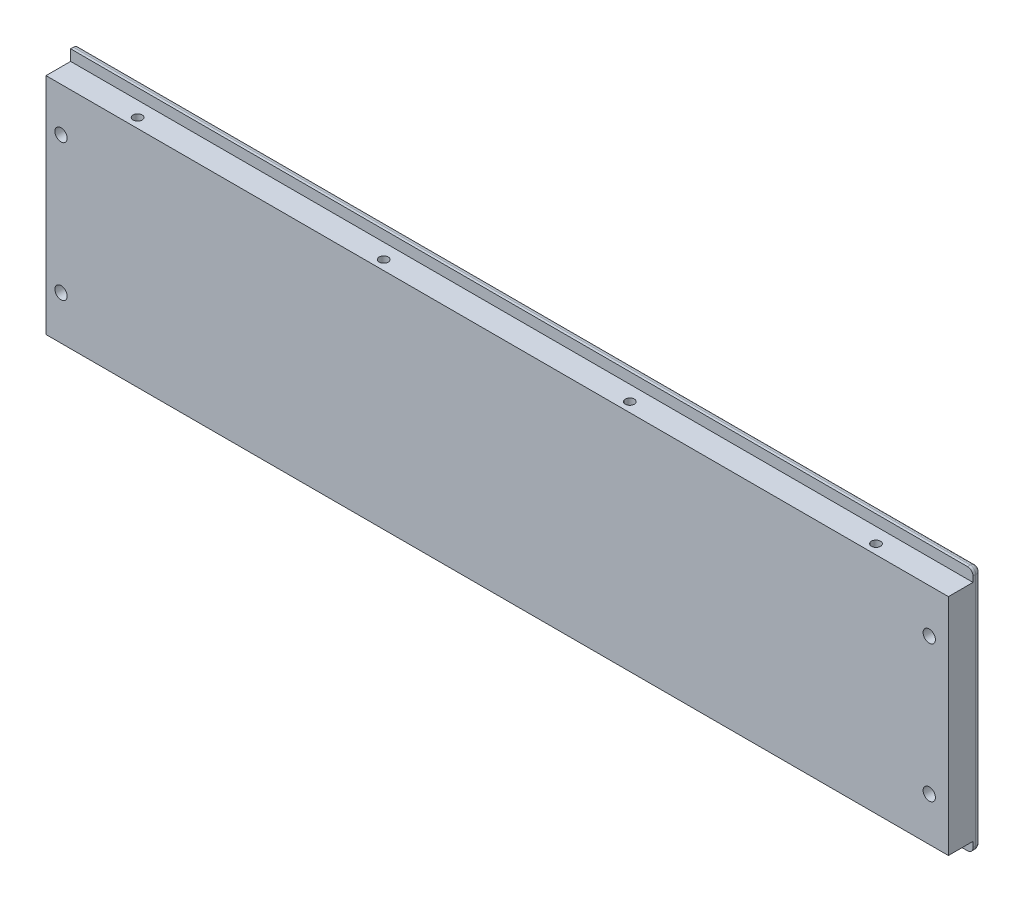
ISO-10303-21;
HEADER;
FILE_DESCRIPTION(('STEP AP214'),'2;1');
FILE_NAME('part.step','',(''),(''),'','','');
FILE_SCHEMA(('AUTOMOTIVE_DESIGN { 1 0 10303 214 1 1 1 1 }'));
ENDSEC;
DATA;
#1=APPLICATION_CONTEXT('core data for automotive mechanical design processes');
#2=APPLICATION_PROTOCOL_DEFINITION('international standard','automotive_design',2000,#1);
#3=PRODUCT_CONTEXT('',#1,'mechanical');
#4=PRODUCT('Part','Part','',(#3));
#5=PRODUCT_RELATED_PRODUCT_CATEGORY('part','',(#4));
#6=PRODUCT_DEFINITION_FORMATION('','',#4);
#7=PRODUCT_DEFINITION_CONTEXT('part definition',#1,'design');
#8=PRODUCT_DEFINITION('design','',#6,#7);
#9=PRODUCT_DEFINITION_SHAPE('','',#8);
#10=(LENGTH_UNIT() NAMED_UNIT(*) SI_UNIT(.MILLI.,.METRE.));
#11=(NAMED_UNIT(*) PLANE_ANGLE_UNIT() SI_UNIT($,.RADIAN.));
#12=(NAMED_UNIT(*) SI_UNIT($,.STERADIAN.) SOLID_ANGLE_UNIT());
#13=UNCERTAINTY_MEASURE_WITH_UNIT(LENGTH_MEASURE(1.E-05),#10,'distance_accuracy_value','');
#14=(GEOMETRIC_REPRESENTATION_CONTEXT(3) GLOBAL_UNCERTAINTY_ASSIGNED_CONTEXT((#13)) GLOBAL_UNIT_ASSIGNED_CONTEXT((#10,
#11,#12)) REPRESENTATION_CONTEXT('',''));
#15=CARTESIAN_POINT('',(0.,0.,0.));
#16=DIRECTION('',(0.,0.,1.));
#17=DIRECTION('',(1.,0.,0.));
#18=AXIS2_PLACEMENT_3D('',#15,#16,#17);
#19=CARTESIAN_POINT('',(0.,0.,12.));
#20=DIRECTION('',(1.,0.,0.));
#21=DIRECTION('',(0.,0.,-1.));
#22=AXIS2_PLACEMENT_3D('',#19,#20,#21);
#23=PLANE('',#22);
#24=DIRECTION('',(0.,-1.,0.));
#25=VECTOR('',#24,1.);
#26=CARTESIAN_POINT('',(0.,0.,0.));
#27=LINE('',#26,#25);
#28=CARTESIAN_POINT('',(0.,88.,0.));
#29=VERTEX_POINT('',#28);
#30=CARTESIAN_POINT('',(0.,2.,0.));
#31=VERTEX_POINT('',#30);
#32=EDGE_CURVE('E160',#29,#31,#27,.T.);
#33=ORIENTED_EDGE('',*,*,#32,.T.);
#34=CARTESIAN_POINT('',(0.,2.,2.));
#35=DIRECTION('',(1.,0.,0.));
#36=DIRECTION('',(0.,0.,-1.));
#37=AXIS2_PLACEMENT_3D('',#34,#35,#36);
#38=CIRCLE('',#37,2.);
#39=CARTESIAN_POINT('',(0.,0.,2.));
#40=VERTEX_POINT('',#39);
#41=EDGE_CURVE('E201',#31,#40,#38,.F.);
#42=ORIENTED_EDGE('',*,*,#41,.T.);
#43=DIRECTION('',(0.,0.,-1.));
#44=VECTOR('',#43,1.);
#45=CARTESIAN_POINT('',(0.,0.,12.));
#46=LINE('',#45,#44);
#47=CARTESIAN_POINT('',(0.,0.,3.));
#48=VERTEX_POINT('',#47);
#49=EDGE_CURVE('E189',#48,#40,#46,.T.);
#50=ORIENTED_EDGE('',*,*,#49,.F.);
#51=DIRECTION('',(0.,-1.,0.));
#52=VECTOR('',#51,1.);
#53=CARTESIAN_POINT('',(0.,0.,3.));
#54=LINE('',#53,#52);
#55=CARTESIAN_POINT('',(0.,4.,3.));
#56=VERTEX_POINT('',#55);
#57=EDGE_CURVE('E166',#56,#48,#54,.T.);
#58=ORIENTED_EDGE('',*,*,#57,.F.);
#59=DIRECTION('',(0.,0.,-1.));
#60=VECTOR('',#59,1.);
#61=CARTESIAN_POINT('',(0.,4.,12.));
#62=LINE('',#61,#60);
#63=CARTESIAN_POINT('',(0.,4.,12.));
#64=VERTEX_POINT('',#63);
#65=EDGE_CURVE('E170',#64,#56,#62,.T.);
#66=ORIENTED_EDGE('',*,*,#65,.F.);
#67=DIRECTION('',(0.,-1.,0.));
#68=VECTOR('',#67,1.);
#69=CARTESIAN_POINT('',(0.,0.,12.));
#70=LINE('',#69,#68);
#71=CARTESIAN_POINT('',(0.,86.,12.));
#72=VERTEX_POINT('',#71);
#73=EDGE_CURVE('E179',#72,#64,#70,.T.);
#74=ORIENTED_EDGE('',*,*,#73,.F.);
#75=DIRECTION('',(0.,0.,1.));
#76=VECTOR('',#75,1.);
#77=CARTESIAN_POINT('',(0.,86.,12.));
#78=LINE('',#77,#76);
#79=CARTESIAN_POINT('',(0.,86.,3.));
#80=VERTEX_POINT('',#79);
#81=EDGE_CURVE('E139',#80,#72,#78,.T.);
#82=ORIENTED_EDGE('',*,*,#81,.F.);
#83=DIRECTION('',(0.,-1.,0.));
#84=VECTOR('',#83,1.);
#85=CARTESIAN_POINT('',(0.,90.,3.));
#86=LINE('',#85,#84);
#87=CARTESIAN_POINT('',(0.,90.,3.));
#88=VERTEX_POINT('',#87);
#89=EDGE_CURVE('E145',#88,#80,#86,.T.);
#90=ORIENTED_EDGE('',*,*,#89,.F.);
#91=DIRECTION('',(0.,0.,-1.));
#92=VECTOR('',#91,1.);
#93=CARTESIAN_POINT('',(0.,90.,12.));
#94=LINE('',#93,#92);
#95=CARTESIAN_POINT('',(0.,90.,2.));
#96=VERTEX_POINT('',#95);
#97=EDGE_CURVE('E184',#88,#96,#94,.T.);
#98=ORIENTED_EDGE('',*,*,#97,.T.);
#99=CARTESIAN_POINT('',(0.,88.,2.));
#100=DIRECTION('',(1.,0.,0.));
#101=DIRECTION('',(0.,0.,-1.));
#102=AXIS2_PLACEMENT_3D('',#99,#100,#101);
#103=CIRCLE('',#102,2.);
#104=EDGE_CURVE('E199',#96,#29,#103,.F.);
#105=ORIENTED_EDGE('',*,*,#104,.T.);
#106=EDGE_LOOP('',(#33,#42,#50,#58,#66,#74,#82,#90,#98,#105));
#107=FACE_BOUND('',#106,.T.);
#108=ADVANCED_FACE('F37',(#107),#23,.F.);
#109=CARTESIAN_POINT('',(0.,0.,12.));
#110=DIRECTION('',(0.,1.,0.));
#111=DIRECTION('',(0.,0.,1.));
#112=AXIS2_PLACEMENT_3D('',#109,#110,#111);
#113=PLANE('',#112);
#114=DIRECTION('',(1.,0.,0.));
#115=VECTOR('',#114,1.);
#116=CARTESIAN_POINT('',(330.,0.,2.));
#117=LINE('',#116,#115);
#118=CARTESIAN_POINT('',(328.,0.,2.));
#119=VERTEX_POINT('',#118);
#120=EDGE_CURVE('E192',#40,#119,#117,.T.);
#121=ORIENTED_EDGE('',*,*,#120,.T.);
#122=DIRECTION('',(0.,0.,-1.));
#123=VECTOR('',#122,1.);
#124=CARTESIAN_POINT('',(328.,0.,12.));
#125=LINE('',#124,#123);
#126=CARTESIAN_POINT('',(328.,0.,3.));
#127=VERTEX_POINT('',#126);
#128=EDGE_CURVE('E46',#119,#127,#125,.F.);
#129=ORIENTED_EDGE('',*,*,#128,.T.);
#130=DIRECTION('',(-1.,0.,0.));
#131=VECTOR('',#130,1.);
#132=CARTESIAN_POINT('',(330.,0.,3.));
#133=LINE('',#132,#131);
#134=EDGE_CURVE('E158',#127,#48,#133,.T.);
#135=ORIENTED_EDGE('',*,*,#134,.T.);
#136=ORIENTED_EDGE('',*,*,#49,.T.);
#137=EDGE_LOOP('',(#121,#129,#135,#136));
#138=FACE_BOUND('',#137,.T.);
#139=ADVANCED_FACE('F253',(#138),#113,.F.);
#140=CARTESIAN_POINT('',(330.,0.,12.));
#141=DIRECTION('',(-1.,0.,0.));
#142=DIRECTION('',(0.,0.,1.));
#143=AXIS2_PLACEMENT_3D('',#140,#141,#142);
#144=PLANE('',#143);
#145=DIRECTION('',(0.,1.,0.));
#146=VECTOR('',#145,1.);
#147=CARTESIAN_POINT('',(330.,88.,2.));
#148=LINE('',#147,#146);
#149=CARTESIAN_POINT('',(330.,2.,2.));
#150=VERTEX_POINT('',#149);
#151=CARTESIAN_POINT('',(330.,88.,2.));
#152=VERTEX_POINT('',#151);
#153=EDGE_CURVE('E210',#150,#152,#148,.T.);
#154=ORIENTED_EDGE('',*,*,#153,.T.);
#155=DIRECTION('',(0.,0.,-1.));
#156=VECTOR('',#155,1.);
#157=CARTESIAN_POINT('',(330.,88.,12.));
#158=LINE('',#157,#156);
#159=CARTESIAN_POINT('',(330.,88.,3.));
#160=VERTEX_POINT('',#159);
#161=EDGE_CURVE('E136',#152,#160,#158,.F.);
#162=ORIENTED_EDGE('',*,*,#161,.T.);
#163=DIRECTION('',(0.,-1.,0.));
#164=VECTOR('',#163,1.);
#165=CARTESIAN_POINT('',(330.,90.,3.));
#166=LINE('',#165,#164);
#167=CARTESIAN_POINT('',(330.,86.,3.));
#168=VERTEX_POINT('',#167);
#169=EDGE_CURVE('E128',#160,#168,#166,.T.);
#170=ORIENTED_EDGE('',*,*,#169,.T.);
#171=DIRECTION('',(0.,0.,1.));
#172=VECTOR('',#171,1.);
#173=CARTESIAN_POINT('',(330.,86.,12.));
#174=LINE('',#173,#172);
#175=CARTESIAN_POINT('',(330.,86.,12.));
#176=VERTEX_POINT('',#175);
#177=EDGE_CURVE('E133',#168,#176,#174,.T.);
#178=ORIENTED_EDGE('',*,*,#177,.T.);
#179=DIRECTION('',(0.,1.,0.));
#180=VECTOR('',#179,1.);
#181=CARTESIAN_POINT('',(330.,0.,12.));
#182=LINE('',#181,#180);
#183=CARTESIAN_POINT('',(330.,4.,12.));
#184=VERTEX_POINT('',#183);
#185=EDGE_CURVE('E182',#184,#176,#182,.T.);
#186=ORIENTED_EDGE('',*,*,#185,.F.);
#187=DIRECTION('',(0.,0.,-1.));
#188=VECTOR('',#187,1.);
#189=CARTESIAN_POINT('',(330.,4.,12.));
#190=LINE('',#189,#188);
#191=CARTESIAN_POINT('',(330.,4.,3.));
#192=VERTEX_POINT('',#191);
#193=EDGE_CURVE('E162',#184,#192,#190,.T.);
#194=ORIENTED_EDGE('',*,*,#193,.T.);
#195=DIRECTION('',(0.,-1.,0.));
#196=VECTOR('',#195,1.);
#197=CARTESIAN_POINT('',(330.,0.,3.));
#198=LINE('',#197,#196);
#199=CARTESIAN_POINT('',(330.,2.,3.));
#200=VERTEX_POINT('',#199);
#201=EDGE_CURVE('E165',#192,#200,#198,.T.);
#202=ORIENTED_EDGE('',*,*,#201,.T.);
#203=DIRECTION('',(0.,0.,-1.));
#204=VECTOR('',#203,1.);
#205=CARTESIAN_POINT('',(330.,2.,12.));
#206=LINE('',#205,#204);
#207=EDGE_CURVE('E208',#200,#150,#206,.T.);
#208=ORIENTED_EDGE('',*,*,#207,.T.);
#209=EDGE_LOOP('',(#154,#162,#170,#178,#186,#194,#202,#208));
#210=FACE_BOUND('',#209,.T.);
#211=ADVANCED_FACE('F130',(#210),#144,.F.);
#212=CARTESIAN_POINT('',(0.,90.,12.));
#213=DIRECTION('',(0.,-1.,0.));
#214=DIRECTION('',(0.,0.,-1.));
#215=AXIS2_PLACEMENT_3D('',#212,#213,#214);
#216=PLANE('',#215);
#217=DIRECTION('',(-1.,0.,0.));
#218=VECTOR('',#217,1.);
#219=CARTESIAN_POINT('',(330.,90.,3.));
#220=LINE('',#219,#218);
#221=CARTESIAN_POINT('',(328.,90.,3.));
#222=VERTEX_POINT('',#221);
#223=EDGE_CURVE('E149',#222,#88,#220,.T.);
#224=ORIENTED_EDGE('',*,*,#223,.F.);
#225=DIRECTION('',(0.,0.,-1.));
#226=VECTOR('',#225,1.);
#227=CARTESIAN_POINT('',(328.,90.,12.));
#228=LINE('',#227,#226);
#229=CARTESIAN_POINT('',(328.,90.,2.));
#230=VERTEX_POINT('',#229);
#231=EDGE_CURVE('E205',#222,#230,#228,.T.);
#232=ORIENTED_EDGE('',*,*,#231,.T.);
#233=DIRECTION('',(-1.,0.,0.));
#234=VECTOR('',#233,1.);
#235=CARTESIAN_POINT('',(0.,90.,2.));
#236=LINE('',#235,#234);
#237=EDGE_CURVE('E203',#230,#96,#236,.T.);
#238=ORIENTED_EDGE('',*,*,#237,.T.);
#239=ORIENTED_EDGE('',*,*,#97,.F.);
#240=EDGE_LOOP('',(#224,#232,#238,#239));
#241=FACE_BOUND('',#240,.T.);
#242=ADVANCED_FACE('F275',(#241),#216,.F.);
#243=CARTESIAN_POINT('',(0.,0.,12.));
#244=DIRECTION('',(0.,0.,-1.));
#245=DIRECTION('',(-1.,0.,0.));
#246=AXIS2_PLACEMENT_3D('',#243,#244,#245);
#247=PLANE('',#246);
#248=CARTESIAN_POINT('',(323.,20.,12.));
#249=DIRECTION('',(0.,0.,-1.));
#250=DIRECTION('',(-1.,0.,0.));
#251=AXIS2_PLACEMENT_3D('',#248,#249,#250);
#252=CIRCLE('',#251,2.24999999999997);
#253=CARTESIAN_POINT('',(320.75,20.,12.));
#254=VERTEX_POINT('',#253);
#255=EDGE_CURVE('E496',#254,#254,#252,.T.);
#256=ORIENTED_EDGE('',*,*,#255,.T.);
#257=EDGE_LOOP('',(#256));
#258=FACE_BOUND('',#257,.T.);
#259=CARTESIAN_POINT('',(323.,70.,12.));
#260=DIRECTION('',(0.,0.,-1.));
#261=DIRECTION('',(-1.,0.,0.));
#262=AXIS2_PLACEMENT_3D('',#259,#260,#261);
#263=CIRCLE('',#262,2.24999999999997);
#264=CARTESIAN_POINT('',(320.75,70.,12.));
#265=VERTEX_POINT('',#264);
#266=EDGE_CURVE('E507',#265,#265,#263,.T.);
#267=ORIENTED_EDGE('',*,*,#266,.T.);
#268=EDGE_LOOP('',(#267));
#269=FACE_BOUND('',#268,.T.);
#270=CARTESIAN_POINT('',(5.5,20.,12.));
#271=DIRECTION('',(0.,0.,-1.));
#272=DIRECTION('',(-1.,0.,0.));
#273=AXIS2_PLACEMENT_3D('',#270,#271,#272);
#274=CIRCLE('',#273,2.25);
#275=CARTESIAN_POINT('',(3.25,20.,12.));
#276=VERTEX_POINT('',#275);
#277=EDGE_CURVE('E516',#276,#276,#274,.T.);
#278=ORIENTED_EDGE('',*,*,#277,.T.);
#279=EDGE_LOOP('',(#278));
#280=FACE_BOUND('',#279,.T.);
#281=CARTESIAN_POINT('',(5.5,70.,12.));
#282=DIRECTION('',(0.,0.,-1.));
#283=DIRECTION('',(-1.,0.,0.));
#284=AXIS2_PLACEMENT_3D('',#281,#282,#283);
#285=CIRCLE('',#284,2.25);
#286=CARTESIAN_POINT('',(3.25,70.,12.));
#287=VERTEX_POINT('',#286);
#288=EDGE_CURVE('E525',#287,#287,#285,.T.);
#289=ORIENTED_EDGE('',*,*,#288,.T.);
#290=EDGE_LOOP('',(#289));
#291=FACE_BOUND('',#290,.T.);
#292=ORIENTED_EDGE('',*,*,#185,.T.);
#293=DIRECTION('',(-1.,0.,0.));
#294=VECTOR('',#293,1.);
#295=CARTESIAN_POINT('',(330.,86.,12.));
#296=LINE('',#295,#294);
#297=EDGE_CURVE('E148',#176,#72,#296,.T.);
#298=ORIENTED_EDGE('',*,*,#297,.T.);
#299=ORIENTED_EDGE('',*,*,#73,.T.);
#300=DIRECTION('',(-1.,0.,0.));
#301=VECTOR('',#300,1.);
#302=CARTESIAN_POINT('',(330.,4.,12.));
#303=LINE('',#302,#301);
#304=EDGE_CURVE('E169',#184,#64,#303,.T.);
#305=ORIENTED_EDGE('',*,*,#304,.F.);
#306=EDGE_LOOP('',(#292,#298,#299,#305));
#307=FACE_BOUND('',#306,.T.);
#308=ADVANCED_FACE('F247',(#258,#269,#280,#291,#307),#247,.F.);
#309=CARTESIAN_POINT('',(0.,0.,0.));
#310=DIRECTION('',(0.,0.,-1.));
#311=DIRECTION('',(-1.,0.,0.));
#312=AXIS2_PLACEMENT_3D('',#309,#310,#311);
#313=PLANE('',#312);
#314=CARTESIAN_POINT('',(323.,20.,0.));
#315=DIRECTION('',(0.,0.,-1.));
#316=DIRECTION('',(-1.,0.,0.));
#317=AXIS2_PLACEMENT_3D('',#314,#315,#316);
#318=CIRCLE('',#317,4.69999999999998);
#319=CARTESIAN_POINT('',(318.3,20.,0.));
#320=VERTEX_POINT('',#319);
#321=EDGE_CURVE('E494',#320,#320,#318,.T.);
#322=ORIENTED_EDGE('',*,*,#321,.F.);
#323=EDGE_LOOP('',(#322));
#324=FACE_BOUND('',#323,.T.);
#325=CARTESIAN_POINT('',(323.,70.,0.));
#326=DIRECTION('',(0.,0.,-1.));
#327=DIRECTION('',(-1.,0.,0.));
#328=AXIS2_PLACEMENT_3D('',#325,#326,#327);
#329=CIRCLE('',#328,4.69999999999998);
#330=CARTESIAN_POINT('',(318.3,70.,0.));
#331=VERTEX_POINT('',#330);
#332=EDGE_CURVE('E501',#331,#331,#329,.T.);
#333=ORIENTED_EDGE('',*,*,#332,.F.);
#334=EDGE_LOOP('',(#333));
#335=FACE_BOUND('',#334,.T.);
#336=CARTESIAN_POINT('',(5.5,20.,0.));
#337=DIRECTION('',(0.,0.,-1.));
#338=DIRECTION('',(-1.,0.,0.));
#339=AXIS2_PLACEMENT_3D('',#336,#337,#338);
#340=CIRCLE('',#339,4.7);
#341=CARTESIAN_POINT('',(0.8,20.,0.));
#342=VERTEX_POINT('',#341);
#343=EDGE_CURVE('E510',#342,#342,#340,.T.);
#344=ORIENTED_EDGE('',*,*,#343,.F.);
#345=EDGE_LOOP('',(#344));
#346=FACE_BOUND('',#345,.T.);
#347=CARTESIAN_POINT('',(5.5,70.,0.));
#348=DIRECTION('',(0.,0.,-1.));
#349=DIRECTION('',(-1.,0.,0.));
#350=AXIS2_PLACEMENT_3D('',#347,#348,#349);
#351=CIRCLE('',#350,4.7);
#352=CARTESIAN_POINT('',(0.8,70.,0.));
#353=VERTEX_POINT('',#352);
#354=EDGE_CURVE('E519',#353,#353,#351,.T.);
#355=ORIENTED_EDGE('',*,*,#354,.F.);
#356=EDGE_LOOP('',(#355));
#357=FACE_BOUND('',#356,.T.);
#358=DIRECTION('',(-1.,0.,0.));
#359=VECTOR('',#358,1.);
#360=CARTESIAN_POINT('',(330.,88.,0.));
#361=LINE('',#360,#359);
#362=CARTESIAN_POINT('',(328.,88.,0.));
#363=VERTEX_POINT('',#362);
#364=EDGE_CURVE('E194',#29,#363,#361,.F.);
#365=ORIENTED_EDGE('',*,*,#364,.T.);
#366=DIRECTION('',(0.,1.,0.));
#367=VECTOR('',#366,1.);
#368=CARTESIAN_POINT('',(328.,2.,0.));
#369=LINE('',#368,#367);
#370=CARTESIAN_POINT('',(328.,2.,0.));
#371=VERTEX_POINT('',#370);
#372=EDGE_CURVE('E217',#363,#371,#369,.F.);
#373=ORIENTED_EDGE('',*,*,#372,.T.);
#374=DIRECTION('',(1.,0.,0.));
#375=VECTOR('',#374,1.);
#376=CARTESIAN_POINT('',(0.,2.,0.));
#377=LINE('',#376,#375);
#378=EDGE_CURVE('E197',#371,#31,#377,.F.);
#379=ORIENTED_EDGE('',*,*,#378,.T.);
#380=ORIENTED_EDGE('',*,*,#32,.F.);
#381=EDGE_LOOP('',(#365,#373,#379,#380));
#382=FACE_BOUND('',#381,.T.);
#383=ADVANCED_FACE('F257',(#324,#335,#346,#357,#382),#313,.T.);
#384=CARTESIAN_POINT('',(330.,0.,3.));
#385=DIRECTION('',(0.,0.,-1.));
#386=DIRECTION('',(-1.,0.,0.));
#387=AXIS2_PLACEMENT_3D('',#384,#385,#386);
#388=PLANE('',#387);
#389=ORIENTED_EDGE('',*,*,#134,.F.);
#390=CARTESIAN_POINT('',(328.,2.,3.));
#391=DIRECTION('',(0.,0.,-1.));
#392=DIRECTION('',(-1.,0.,0.));
#393=AXIS2_PLACEMENT_3D('',#390,#391,#392);
#394=CIRCLE('',#393,2.);
#395=EDGE_CURVE('E11',#127,#200,#394,.F.);
#396=ORIENTED_EDGE('',*,*,#395,.T.);
#397=ORIENTED_EDGE('',*,*,#201,.F.);
#398=DIRECTION('',(-1.,0.,0.));
#399=VECTOR('',#398,1.);
#400=CARTESIAN_POINT('',(330.,4.,3.));
#401=LINE('',#400,#399);
#402=EDGE_CURVE('E176',#192,#56,#401,.T.);
#403=ORIENTED_EDGE('',*,*,#402,.T.);
#404=ORIENTED_EDGE('',*,*,#57,.T.);
#405=EDGE_LOOP('',(#389,#396,#397,#403,#404));
#406=FACE_BOUND('',#405,.T.);
#407=ADVANCED_FACE('F241',(#406),#388,.F.);
#408=CARTESIAN_POINT('',(330.,4.,12.));
#409=DIRECTION('',(0.,1.,0.));
#410=DIRECTION('',(0.,0.,1.));
#411=AXIS2_PLACEMENT_3D('',#408,#409,#410);
#412=PLANE('',#411);
#413=CARTESIAN_POINT('',(30.,4.,8.5));
#414=DIRECTION('',(0.,1.,0.));
#415=DIRECTION('',(0.,0.,1.));
#416=AXIS2_PLACEMENT_3D('',#413,#414,#415);
#417=CIRCLE('',#416,1.64999999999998);
#418=CARTESIAN_POINT('',(30.,4.,10.15));
#419=VERTEX_POINT('',#418);
#420=EDGE_CURVE('E531',#419,#419,#417,.T.);
#421=ORIENTED_EDGE('',*,*,#420,.T.);
#422=EDGE_LOOP('',(#421));
#423=FACE_BOUND('',#422,.T.);
#424=CARTESIAN_POINT('',(120.,4.,8.5));
#425=DIRECTION('',(0.,1.,0.));
#426=DIRECTION('',(0.,0.,1.));
#427=AXIS2_PLACEMENT_3D('',#424,#425,#426);
#428=CIRCLE('',#427,1.64999999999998);
#429=CARTESIAN_POINT('',(120.,4.,10.15));
#430=VERTEX_POINT('',#429);
#431=EDGE_CURVE('E537',#430,#430,#428,.T.);
#432=ORIENTED_EDGE('',*,*,#431,.T.);
#433=EDGE_LOOP('',(#432));
#434=FACE_BOUND('',#433,.T.);
#435=CARTESIAN_POINT('',(210.,4.,8.5));
#436=DIRECTION('',(0.,1.,0.));
#437=DIRECTION('',(0.,0.,1.));
#438=AXIS2_PLACEMENT_3D('',#435,#436,#437);
#439=CIRCLE('',#438,1.64999999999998);
#440=CARTESIAN_POINT('',(210.,4.,10.15));
#441=VERTEX_POINT('',#440);
#442=EDGE_CURVE('E543',#441,#441,#439,.T.);
#443=ORIENTED_EDGE('',*,*,#442,.T.);
#444=EDGE_LOOP('',(#443));
#445=FACE_BOUND('',#444,.T.);
#446=CARTESIAN_POINT('',(300.,4.,8.5));
#447=DIRECTION('',(0.,1.,0.));
#448=DIRECTION('',(0.,0.,1.));
#449=AXIS2_PLACEMENT_3D('',#446,#447,#448);
#450=CIRCLE('',#449,1.64999999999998);
#451=CARTESIAN_POINT('',(300.,4.,10.15));
#452=VERTEX_POINT('',#451);
#453=EDGE_CURVE('E224',#452,#452,#450,.T.);
#454=ORIENTED_EDGE('',*,*,#453,.T.);
#455=EDGE_LOOP('',(#454));
#456=FACE_BOUND('',#455,.T.);
#457=ORIENTED_EDGE('',*,*,#65,.T.);
#458=ORIENTED_EDGE('',*,*,#402,.F.);
#459=ORIENTED_EDGE('',*,*,#193,.F.);
#460=ORIENTED_EDGE('',*,*,#304,.T.);
#461=EDGE_LOOP('',(#457,#458,#459,#460));
#462=FACE_BOUND('',#461,.T.);
#463=ADVANCED_FACE('F244',(#423,#434,#445,#456,#462),#412,.F.);
#464=CARTESIAN_POINT('',(330.,86.,12.));
#465=DIRECTION('',(0.,-1.,0.));
#466=DIRECTION('',(0.,0.,-1.));
#467=AXIS2_PLACEMENT_3D('',#464,#465,#466);
#468=PLANE('',#467);
#469=CARTESIAN_POINT('',(30.,86.,8.5));
#470=DIRECTION('',(0.,1.,0.));
#471=DIRECTION('',(0.,0.,1.));
#472=AXIS2_PLACEMENT_3D('',#469,#470,#471);
#473=CIRCLE('',#472,1.64999999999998);
#474=CARTESIAN_POINT('',(30.,86.,10.15));
#475=VERTEX_POINT('',#474);
#476=EDGE_CURVE('E528',#475,#475,#473,.T.);
#477=ORIENTED_EDGE('',*,*,#476,.F.);
#478=EDGE_LOOP('',(#477));
#479=FACE_BOUND('',#478,.T.);
#480=CARTESIAN_POINT('',(120.,86.,8.5));
#481=DIRECTION('',(0.,1.,0.));
#482=DIRECTION('',(0.,0.,1.));
#483=AXIS2_PLACEMENT_3D('',#480,#481,#482);
#484=CIRCLE('',#483,1.64999999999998);
#485=CARTESIAN_POINT('',(120.,86.,10.15));
#486=VERTEX_POINT('',#485);
#487=EDGE_CURVE('E534',#486,#486,#484,.T.);
#488=ORIENTED_EDGE('',*,*,#487,.F.);
#489=EDGE_LOOP('',(#488));
#490=FACE_BOUND('',#489,.T.);
#491=CARTESIAN_POINT('',(210.,86.,8.5));
#492=DIRECTION('',(0.,1.,0.));
#493=DIRECTION('',(0.,0.,1.));
#494=AXIS2_PLACEMENT_3D('',#491,#492,#493);
#495=CIRCLE('',#494,1.64999999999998);
#496=CARTESIAN_POINT('',(210.,86.,10.15));
#497=VERTEX_POINT('',#496);
#498=EDGE_CURVE('E540',#497,#497,#495,.T.);
#499=ORIENTED_EDGE('',*,*,#498,.F.);
#500=EDGE_LOOP('',(#499));
#501=FACE_BOUND('',#500,.T.);
#502=CARTESIAN_POINT('',(300.,86.,8.5));
#503=DIRECTION('',(0.,1.,0.));
#504=DIRECTION('',(0.,0.,1.));
#505=AXIS2_PLACEMENT_3D('',#502,#503,#504);
#506=CIRCLE('',#505,1.64999999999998);
#507=CARTESIAN_POINT('',(300.,86.,10.15));
#508=VERTEX_POINT('',#507);
#509=EDGE_CURVE('E546',#508,#508,#506,.T.);
#510=ORIENTED_EDGE('',*,*,#509,.F.);
#511=EDGE_LOOP('',(#510));
#512=FACE_BOUND('',#511,.T.);
#513=ORIENTED_EDGE('',*,*,#81,.T.);
#514=ORIENTED_EDGE('',*,*,#297,.F.);
#515=ORIENTED_EDGE('',*,*,#177,.F.);
#516=DIRECTION('',(-1.,0.,0.));
#517=VECTOR('',#516,1.);
#518=CARTESIAN_POINT('',(330.,86.,3.));
#519=LINE('',#518,#517);
#520=EDGE_CURVE('E142',#168,#80,#519,.T.);
#521=ORIENTED_EDGE('',*,*,#520,.T.);
#522=EDGE_LOOP('',(#513,#514,#515,#521));
#523=FACE_BOUND('',#522,.T.);
#524=ADVANCED_FACE('F151',(#479,#490,#501,#512,#523),#468,.F.);
#525=CARTESIAN_POINT('',(330.,90.,3.));
#526=DIRECTION('',(0.,0.,-1.));
#527=DIRECTION('',(-1.,0.,0.));
#528=AXIS2_PLACEMENT_3D('',#525,#526,#527);
#529=PLANE('',#528);
#530=ORIENTED_EDGE('',*,*,#169,.F.);
#531=CARTESIAN_POINT('',(328.,88.,3.));
#532=DIRECTION('',(0.,0.,-1.));
#533=DIRECTION('',(-1.,0.,0.));
#534=AXIS2_PLACEMENT_3D('',#531,#532,#533);
#535=CIRCLE('',#534,2.);
#536=EDGE_CURVE('E213',#160,#222,#535,.F.);
#537=ORIENTED_EDGE('',*,*,#536,.T.);
#538=ORIENTED_EDGE('',*,*,#223,.T.);
#539=ORIENTED_EDGE('',*,*,#89,.T.);
#540=ORIENTED_EDGE('',*,*,#520,.F.);
#541=EDGE_LOOP('',(#530,#537,#538,#539,#540));
#542=FACE_BOUND('',#541,.T.);
#543=ADVANCED_FACE('F143',(#542),#529,.F.);
#544=CARTESIAN_POINT('',(0.,2.,2.));
#545=DIRECTION('',(-1.,0.,0.));
#546=DIRECTION('',(0.,0.,1.));
#547=AXIS2_PLACEMENT_3D('',#544,#545,#546);
#548=CYLINDRICAL_SURFACE('',#547,2.);
#549=ORIENTED_EDGE('',*,*,#378,.F.);
#550=CARTESIAN_POINT('',(328.,2.,2.));
#551=DIRECTION('',(-1.,0.,0.));
#552=DIRECTION('',(0.,0.,1.));
#553=AXIS2_PLACEMENT_3D('',#550,#551,#552);
#554=CIRCLE('',#553,2.);
#555=EDGE_CURVE('E61',#371,#119,#554,.T.);
#556=ORIENTED_EDGE('',*,*,#555,.T.);
#557=ORIENTED_EDGE('',*,*,#120,.F.);
#558=ORIENTED_EDGE('',*,*,#41,.F.);
#559=EDGE_LOOP('',(#549,#556,#557,#558));
#560=FACE_BOUND('',#559,.T.);
#561=ADVANCED_FACE('F254',(#560),#548,.T.);
#562=CARTESIAN_POINT('',(0.,88.,2.));
#563=DIRECTION('',(1.,0.,0.));
#564=DIRECTION('',(0.,0.,-1.));
#565=AXIS2_PLACEMENT_3D('',#562,#563,#564);
#566=CYLINDRICAL_SURFACE('',#565,2.);
#567=ORIENTED_EDGE('',*,*,#237,.F.);
#568=CARTESIAN_POINT('',(328.,88.,2.));
#569=DIRECTION('',(1.,0.,0.));
#570=DIRECTION('',(0.,0.,-1.));
#571=AXIS2_PLACEMENT_3D('',#568,#569,#570);
#572=CIRCLE('',#571,2.);
#573=EDGE_CURVE('E215',#230,#363,#572,.F.);
#574=ORIENTED_EDGE('',*,*,#573,.T.);
#575=ORIENTED_EDGE('',*,*,#364,.F.);
#576=ORIENTED_EDGE('',*,*,#104,.F.);
#577=EDGE_LOOP('',(#567,#574,#575,#576));
#578=FACE_BOUND('',#577,.T.);
#579=ADVANCED_FACE('F263',(#578),#566,.T.);
#580=CARTESIAN_POINT('',(328.,2.,12.));
#581=DIRECTION('',(0.,0.,-1.));
#582=DIRECTION('',(-1.,0.,0.));
#583=AXIS2_PLACEMENT_3D('',#580,#581,#582);
#584=CYLINDRICAL_SURFACE('',#583,2.);
#585=ORIENTED_EDGE('',*,*,#395,.F.);
#586=ORIENTED_EDGE('',*,*,#128,.F.);
#587=CARTESIAN_POINT('',(328.,2.,2.));
#588=DIRECTION('',(0.,0.,-1.));
#589=DIRECTION('',(-1.,0.,0.));
#590=AXIS2_PLACEMENT_3D('',#587,#588,#589);
#591=CIRCLE('',#590,2.);
#592=EDGE_CURVE('E41',#150,#119,#591,.T.);
#593=ORIENTED_EDGE('',*,*,#592,.F.);
#594=ORIENTED_EDGE('',*,*,#207,.F.);
#595=EDGE_LOOP('',(#585,#586,#593,#594));
#596=FACE_BOUND('',#595,.T.);
#597=ADVANCED_FACE('F39',(#596),#584,.T.);
#598=CARTESIAN_POINT('',(328.,2.,2.));
#599=DIRECTION('',(-1.,0.,0.));
#600=DIRECTION('',(0.,0.,1.));
#601=AXIS2_PLACEMENT_3D('',#598,#599,#600);
#602=SPHERICAL_SURFACE('',#601,2.);
#603=ORIENTED_EDGE('',*,*,#592,.T.);
#604=ORIENTED_EDGE('',*,*,#555,.F.);
#605=CARTESIAN_POINT('',(328.,2.,2.));
#606=DIRECTION('',(0.,1.,0.));
#607=DIRECTION('',(0.,0.,1.));
#608=AXIS2_PLACEMENT_3D('',#605,#606,#607);
#609=CIRCLE('',#608,2.);
#610=EDGE_CURVE('E226',#150,#371,#609,.T.);
#611=ORIENTED_EDGE('',*,*,#610,.F.);
#612=EDGE_LOOP('',(#603,#604,#611));
#613=FACE_BOUND('',#612,.T.);
#614=ADVANCED_FACE('F235',(#613),#602,.T.);
#615=CARTESIAN_POINT('',(328.,0.,2.));
#616=DIRECTION('',(0.,-1.,0.));
#617=DIRECTION('',(0.,0.,-1.));
#618=AXIS2_PLACEMENT_3D('',#615,#616,#617);
#619=CYLINDRICAL_SURFACE('',#618,2.);
#620=ORIENTED_EDGE('',*,*,#610,.T.);
#621=ORIENTED_EDGE('',*,*,#372,.F.);
#622=CARTESIAN_POINT('',(328.,88.,2.));
#623=DIRECTION('',(0.,1.,0.));
#624=DIRECTION('',(0.,0.,1.));
#625=AXIS2_PLACEMENT_3D('',#622,#623,#624);
#626=CIRCLE('',#625,2.);
#627=EDGE_CURVE('E223',#152,#363,#626,.T.);
#628=ORIENTED_EDGE('',*,*,#627,.F.);
#629=ORIENTED_EDGE('',*,*,#153,.F.);
#630=EDGE_LOOP('',(#620,#621,#628,#629));
#631=FACE_BOUND('',#630,.T.);
#632=ADVANCED_FACE('F266',(#631),#619,.T.);
#633=CARTESIAN_POINT('',(328.,88.,2.));
#634=DIRECTION('',(-1.,0.,0.));
#635=DIRECTION('',(0.,0.,1.));
#636=AXIS2_PLACEMENT_3D('',#633,#634,#635);
#637=SPHERICAL_SURFACE('',#636,2.);
#638=ORIENTED_EDGE('',*,*,#627,.T.);
#639=ORIENTED_EDGE('',*,*,#573,.F.);
#640=CARTESIAN_POINT('',(328.,88.,2.));
#641=DIRECTION('',(0.,0.,1.));
#642=DIRECTION('',(1.,0.,0.));
#643=AXIS2_PLACEMENT_3D('',#640,#641,#642);
#644=CIRCLE('',#643,2.);
#645=EDGE_CURVE('E221',#152,#230,#644,.T.);
#646=ORIENTED_EDGE('',*,*,#645,.F.);
#647=EDGE_LOOP('',(#638,#639,#646));
#648=FACE_BOUND('',#647,.T.);
#649=ADVANCED_FACE('F269',(#648),#637,.T.);
#650=CARTESIAN_POINT('',(328.,88.,12.));
#651=DIRECTION('',(0.,0.,-1.));
#652=DIRECTION('',(-1.,0.,0.));
#653=AXIS2_PLACEMENT_3D('',#650,#651,#652);
#654=CYLINDRICAL_SURFACE('',#653,2.);
#655=ORIENTED_EDGE('',*,*,#536,.F.);
#656=ORIENTED_EDGE('',*,*,#161,.F.);
#657=ORIENTED_EDGE('',*,*,#645,.T.);
#658=ORIENTED_EDGE('',*,*,#231,.F.);
#659=EDGE_LOOP('',(#655,#656,#657,#658));
#660=FACE_BOUND('',#659,.T.);
#661=ADVANCED_FACE('F272',(#660),#654,.T.);
#662=CARTESIAN_POINT('',(300.,86.,8.5));
#663=DIRECTION('',(0.,1.,0.));
#664=DIRECTION('',(0.,0.,1.));
#665=AXIS2_PLACEMENT_3D('',#662,#663,#664);
#666=CYLINDRICAL_SURFACE('',#665,1.64999999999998);
#667=ORIENTED_EDGE('',*,*,#509,.T.);
#668=EDGE_LOOP('',(#667));
#669=FACE_BOUND('',#668,.T.);
#670=ORIENTED_EDGE('',*,*,#453,.F.);
#671=EDGE_LOOP('',(#670));
#672=FACE_BOUND('',#671,.T.);
#673=ADVANCED_FACE('F299',(#669,#672),#666,.F.);
#674=CARTESIAN_POINT('',(210.,86.,8.5));
#675=DIRECTION('',(0.,1.,0.));
#676=DIRECTION('',(0.,0.,1.));
#677=AXIS2_PLACEMENT_3D('',#674,#675,#676);
#678=CYLINDRICAL_SURFACE('',#677,1.64999999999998);
#679=ORIENTED_EDGE('',*,*,#498,.T.);
#680=EDGE_LOOP('',(#679));
#681=FACE_BOUND('',#680,.T.);
#682=ORIENTED_EDGE('',*,*,#442,.F.);
#683=EDGE_LOOP('',(#682));
#684=FACE_BOUND('',#683,.T.);
#685=ADVANCED_FACE('F381',(#681,#684),#678,.F.);
#686=CARTESIAN_POINT('',(120.,86.,8.5));
#687=DIRECTION('',(0.,1.,0.));
#688=DIRECTION('',(0.,0.,1.));
#689=AXIS2_PLACEMENT_3D('',#686,#687,#688);
#690=CYLINDRICAL_SURFACE('',#689,1.64999999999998);
#691=ORIENTED_EDGE('',*,*,#487,.T.);
#692=EDGE_LOOP('',(#691));
#693=FACE_BOUND('',#692,.T.);
#694=ORIENTED_EDGE('',*,*,#431,.F.);
#695=EDGE_LOOP('',(#694));
#696=FACE_BOUND('',#695,.T.);
#697=ADVANCED_FACE('F369',(#693,#696),#690,.F.);
#698=CARTESIAN_POINT('',(30.,86.,8.5));
#699=DIRECTION('',(0.,1.,0.));
#700=DIRECTION('',(0.,0.,1.));
#701=AXIS2_PLACEMENT_3D('',#698,#699,#700);
#702=CYLINDRICAL_SURFACE('',#701,1.64999999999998);
#703=ORIENTED_EDGE('',*,*,#476,.T.);
#704=EDGE_LOOP('',(#703));
#705=FACE_BOUND('',#704,.T.);
#706=ORIENTED_EDGE('',*,*,#420,.F.);
#707=EDGE_LOOP('',(#706));
#708=FACE_BOUND('',#707,.T.);
#709=ADVANCED_FACE('F362',(#705,#708),#702,.F.);
#710=CARTESIAN_POINT('',(5.5,70.,0.));
#711=DIRECTION('',(0.,0.,-1.));
#712=DIRECTION('',(-1.,0.,0.));
#713=AXIS2_PLACEMENT_3D('',#710,#711,#712);
#714=CYLINDRICAL_SURFACE('',#713,2.24999999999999);
#715=ORIENTED_EDGE('',*,*,#288,.F.);
#716=EDGE_LOOP('',(#715));
#717=FACE_BOUND('',#716,.T.);
#718=CARTESIAN_POINT('',(5.5,70.,2.45000000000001));
#719=DIRECTION('',(0.,0.,-1.));
#720=DIRECTION('',(-1.,0.,0.));
#721=AXIS2_PLACEMENT_3D('',#718,#719,#720);
#722=CIRCLE('',#721,2.24999999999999);
#723=CARTESIAN_POINT('',(3.25000000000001,70.,2.45000000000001));
#724=VERTEX_POINT('',#723);
#725=EDGE_CURVE('E522',#724,#724,#722,.T.);
#726=ORIENTED_EDGE('',*,*,#725,.T.);
#727=EDGE_LOOP('',(#726));
#728=FACE_BOUND('',#727,.T.);
#729=ADVANCED_FACE('F368',(#717,#728),#714,.F.);
#730=CARTESIAN_POINT('',(5.5,70.,0.));
#731=DIRECTION('',(0.,0.,-1.));
#732=DIRECTION('',(-1.,0.,0.));
#733=AXIS2_PLACEMENT_3D('',#730,#731,#732);
#734=CONICAL_SURFACE('',#733,4.7,0.785398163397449);
#735=ORIENTED_EDGE('',*,*,#725,.F.);
#736=EDGE_LOOP('',(#735));
#737=FACE_BOUND('',#736,.T.);
#738=ORIENTED_EDGE('',*,*,#354,.T.);
#739=EDGE_LOOP('',(#738));
#740=FACE_BOUND('',#739,.T.);
#741=ADVANCED_FACE('F414',(#737,#740),#734,.F.);
#742=CARTESIAN_POINT('',(5.5,20.,0.));
#743=DIRECTION('',(0.,0.,-1.));
#744=DIRECTION('',(-1.,0.,0.));
#745=AXIS2_PLACEMENT_3D('',#742,#743,#744);
#746=CYLINDRICAL_SURFACE('',#745,2.24999999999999);
#747=ORIENTED_EDGE('',*,*,#277,.F.);
#748=EDGE_LOOP('',(#747));
#749=FACE_BOUND('',#748,.T.);
#750=CARTESIAN_POINT('',(5.5,20.,2.45000000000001));
#751=DIRECTION('',(0.,0.,-1.));
#752=DIRECTION('',(-1.,0.,0.));
#753=AXIS2_PLACEMENT_3D('',#750,#751,#752);
#754=CIRCLE('',#753,2.24999999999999);
#755=CARTESIAN_POINT('',(3.25000000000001,20.,2.45000000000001));
#756=VERTEX_POINT('',#755);
#757=EDGE_CURVE('E513',#756,#756,#754,.T.);
#758=ORIENTED_EDGE('',*,*,#757,.T.);
#759=EDGE_LOOP('',(#758));
#760=FACE_BOUND('',#759,.T.);
#761=ADVANCED_FACE('F421',(#749,#760),#746,.F.);
#762=CARTESIAN_POINT('',(5.5,20.,0.));
#763=DIRECTION('',(0.,0.,-1.));
#764=DIRECTION('',(-1.,0.,0.));
#765=AXIS2_PLACEMENT_3D('',#762,#763,#764);
#766=CONICAL_SURFACE('',#765,4.7,0.785398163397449);
#767=ORIENTED_EDGE('',*,*,#757,.F.);
#768=EDGE_LOOP('',(#767));
#769=FACE_BOUND('',#768,.T.);
#770=ORIENTED_EDGE('',*,*,#343,.T.);
#771=EDGE_LOOP('',(#770));
#772=FACE_BOUND('',#771,.T.);
#773=ADVANCED_FACE('F429',(#769,#772),#766,.F.);
#774=CARTESIAN_POINT('',(323.,70.,0.));
#775=DIRECTION('',(0.,0.,-1.));
#776=DIRECTION('',(-1.,0.,0.));
#777=AXIS2_PLACEMENT_3D('',#774,#775,#776);
#778=CYLINDRICAL_SURFACE('',#777,2.24999999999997);
#779=ORIENTED_EDGE('',*,*,#266,.F.);
#780=EDGE_LOOP('',(#779));
#781=FACE_BOUND('',#780,.T.);
#782=CARTESIAN_POINT('',(323.,70.,2.45000000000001));
#783=DIRECTION('',(0.,0.,-1.));
#784=DIRECTION('',(-1.,0.,0.));
#785=AXIS2_PLACEMENT_3D('',#782,#783,#784);
#786=CIRCLE('',#785,2.24999999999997);
#787=CARTESIAN_POINT('',(320.75,70.,2.45000000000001));
#788=VERTEX_POINT('',#787);
#789=EDGE_CURVE('E504',#788,#788,#786,.T.);
#790=ORIENTED_EDGE('',*,*,#789,.T.);
#791=EDGE_LOOP('',(#790));
#792=FACE_BOUND('',#791,.T.);
#793=ADVANCED_FACE('F437',(#781,#792),#778,.F.);
#794=CARTESIAN_POINT('',(323.,70.,0.));
#795=DIRECTION('',(0.,0.,-1.));
#796=DIRECTION('',(-1.,0.,0.));
#797=AXIS2_PLACEMENT_3D('',#794,#795,#796);
#798=CONICAL_SURFACE('',#797,4.69999999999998,0.785398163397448);
#799=ORIENTED_EDGE('',*,*,#789,.F.);
#800=EDGE_LOOP('',(#799));
#801=FACE_BOUND('',#800,.T.);
#802=ORIENTED_EDGE('',*,*,#332,.T.);
#803=EDGE_LOOP('',(#802));
#804=FACE_BOUND('',#803,.T.);
#805=ADVANCED_FACE('F445',(#801,#804),#798,.F.);
#806=CARTESIAN_POINT('',(323.,20.,0.));
#807=DIRECTION('',(0.,0.,-1.));
#808=DIRECTION('',(-1.,0.,0.));
#809=AXIS2_PLACEMENT_3D('',#806,#807,#808);
#810=CYLINDRICAL_SURFACE('',#809,2.24999999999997);
#811=ORIENTED_EDGE('',*,*,#255,.F.);
#812=EDGE_LOOP('',(#811));
#813=FACE_BOUND('',#812,.T.);
#814=CARTESIAN_POINT('',(323.,20.,2.45000000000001));
#815=DIRECTION('',(0.,0.,-1.));
#816=DIRECTION('',(-1.,0.,0.));
#817=AXIS2_PLACEMENT_3D('',#814,#815,#816);
#818=CIRCLE('',#817,2.24999999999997);
#819=CARTESIAN_POINT('',(320.75,20.,2.45000000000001));
#820=VERTEX_POINT('',#819);
#821=EDGE_CURVE('E491',#820,#820,#818,.T.);
#822=ORIENTED_EDGE('',*,*,#821,.T.);
#823=EDGE_LOOP('',(#822));
#824=FACE_BOUND('',#823,.T.);
#825=ADVANCED_FACE('F453',(#813,#824),#810,.F.);
#826=CARTESIAN_POINT('',(323.,20.,0.));
#827=DIRECTION('',(0.,0.,-1.));
#828=DIRECTION('',(-1.,0.,0.));
#829=AXIS2_PLACEMENT_3D('',#826,#827,#828);
#830=CONICAL_SURFACE('',#829,4.69999999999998,0.785398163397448);
#831=ORIENTED_EDGE('',*,*,#821,.F.);
#832=EDGE_LOOP('',(#831));
#833=FACE_BOUND('',#832,.T.);
#834=ORIENTED_EDGE('',*,*,#321,.T.);
#835=EDGE_LOOP('',(#834));
#836=FACE_BOUND('',#835,.T.);
#837=ADVANCED_FACE('F461',(#833,#836),#830,.F.);
#838=CLOSED_SHELL('',(#108,#139,#211,#242,#308,#383,#407,#463,#524,#543,#561,#579,#597,#614,
#632,#649,#661,#673,#685,#697,#709,#729,#741,#761,#773,#793,#805,#825,#837));
#839=MANIFOLD_SOLID_BREP('B2',#838);
#840=ADVANCED_BREP_SHAPE_REPRESENTATION('',(#18,#839),#14);
#841=SHAPE_DEFINITION_REPRESENTATION(#9,#840);
ENDSEC;
END-ISO-10303-21;
